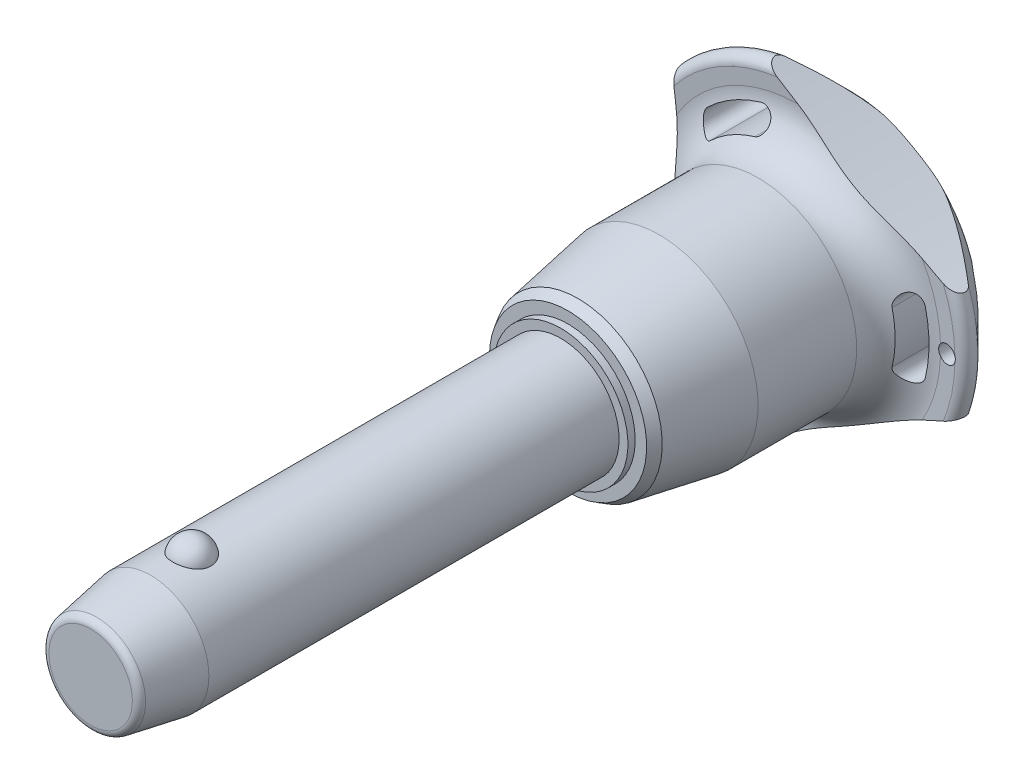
from build123d import *

# Parameters (mm, degrees)
SKETCH1_R           = 10
BOSS_EXTRUDE1_DEPTH = 60
SKETCH2_R           = 8.75
BOSS_EXTRUDE2_DEPTH = 50.7
BOSS_EXTRUDE3_START = 20.5
SKETCH1_2_R         = 10
BOSS_EXTRUDE3_DEPTH = 20.5
CHAMFER1_SIZE       = 10.25
CHAMFER1_SIZE2      = 1.807351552
FILLET1_R           = 1.25
SKETCH6_R           = 176.92625
CUT_EXTRUDE1_DEPTH  = 118.833791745
CIRPATTERN1_COUNT   = 3
SKETCH7_R           = 1.5
CUT_EXTRUDE2_DEPTH  = 118.704532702


with BuildPart() as part:
    # Sketch1 → Boss-Extrude1 (new body)
    with BuildSketch(Plane.XY):
        Circle(SKETCH1_R)
    extrude(amount=-BOSS_EXTRUDE1_DEPTH)

    # Sketch2 → Boss-Extrude2 (add)
    with BuildSketch(Plane(origin=(0, 0, -60), x_dir=(-1, 0, 0), z_dir=(0, 0, -1))):
        with Locations(Location((0, 0, 0), (0, 0, 180))):
            Circle(SKETCH2_R)
    extrude(amount=BOSS_EXTRUDE2_DEPTH)

    # Sketch3 → Revolve1 (revolve)
    with BuildSketch(Plane(origin=(0, 0, 0), x_dir=(0, 0, -1), z_dir=(1, 0, 0))):
        with BuildLine():
            Line((-3.201562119, 12.5), (-3.201562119, 5.9))
            ThreePointArc((-3.201562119, 5.9), (0.098437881, 9.2), (-3.201562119, 12.5))
        make_face()
        with BuildLine():
            Line((-3.201562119, -5.9), (-3.201562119, -12.5))
            ThreePointArc((-3.201562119, -12.5), (0.098437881, -9.2), (-3.201562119, -5.9))
        make_face()
    revolve(axis=Axis((0, -5.9, 3.201562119), (0, 1, 0)))

    # Sketch1_2 → Boss-Extrude3 (add)
    with BuildSketch(Plane.XY.offset(BOSS_EXTRUDE3_START)):
        Circle(SKETCH1_2_R)
    extrude(amount=-BOSS_EXTRUDE3_DEPTH)

    # Chamfer1
    chamfer1_edges = [part.edges().sort_by_distance(p)[0] for p in [
        (-10, 0, 20.5),
    ]]
    chamfer1_side = [part.faces().sort_by_distance(p)[0] for p in [
        (-10, 0, -19.75),
    ]]
    chamfer(chamfer1_edges, length=CHAMFER1_SIZE, length2=CHAMFER1_SIZE2, reference=chamfer1_side[0])

    # Fillet1
    fillet1_edges = [part.edges().sort_by_distance(p)[0] for p in [
        (-8.192648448, 0, 20.5),
        (-8.75, 0, -110.7),
    ]]
    fillet(fillet1_edges, radius=FILLET1_R)

    # Sketch4 → Revolve2 (revolve)
    with BuildSketch(Plane(origin=(0, 0, 0), x_dir=(0, 0, -1), z_dir=(1, 0, 0)), mode=Mode.PRIVATE) as revolve2_sk:
        Polygon((60, 0), (60, 11.504815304), (61.25, 11.504815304), (61.25, 13.461079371), (62.944174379, 14.439211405), (76.9, 16.9), (93.8, 16.9), (93.8, 0), align=None)
    revolve(revolve2_sk.sketch.rotate(Axis((0, 0, -93.8), (0, 0, 1)), 90), axis=Axis((0, 0, -93.8), (0, 0, 1)))

    # Sketch5 → Revolve3 (revolve)
    with BuildSketch(Plane(origin=(0, 0, 0), x_dir=(0, 0, -1), z_dir=(1, 0, 0)), mode=Mode.PRIVATE) as revolve3_sk:
        with BuildLine():
            Line((100.790129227, 24.271609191), (100.652256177, 26.865060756))
            ThreePointArc((100.652256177, 26.865060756), (101.598671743, 28.411427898), (103.38137085, 28.08137085))
            Line((103.38137085, 28.08137085), (109.763226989, 21.69951471))
            ThreePointArc((109.763226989, 21.69951471), (110.7, 19.381044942), (109.683055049, 17.096604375))
            ThreePointArc((109.683055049, 17.096604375), (104.18864484, 9.321268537), (102.25, 0))
            Line((102.25, 0), (93.8, 0))
            Line((93.8, 0), (93.8, 16.9))
            ThreePointArc((93.8, 16.9), (98.879432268, 19.083427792), (100.790129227, 24.271609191))
        make_face()
    revolve(revolve3_sk.sketch.rotate(Axis((0, 0, -102.25), (0, 0, 1)), 90), axis=Axis((0, 0, -102.25), (0, 0, 1)))

    # Sketch6 → Cut-Extrude1 (cut, through all)
    with BuildSketch(Plane.XY):
        with Locations((-197.42625, 0)):
            Circle(SKETCH6_R)
        with BuildLine():
            ThreePointArc((21.802992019, -5.260839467), (22.428706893, 0), (21.802992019, 5.260839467))
            ThreePointArc((21.802992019, 5.260839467), (19.579234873, 6.620060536), (18.220013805, 4.39630339))
            ThreePointArc((18.220013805, 4.39630339), (18.742902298, 0), (18.220013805, -4.39630339))
            ThreePointArc((18.220013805, -4.39630339), (19.579234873, -6.620060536), (21.802992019, -5.260839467))
        make_face()
    cut_extrude1 = extrude(amount=-CUT_EXTRUDE1_DEPTH, mode=Mode.SUBTRACT)

    # CirPattern1: Cut-Extrude1 ×3 about axis
    cirpattern1_axis = Axis((0, 0, 0), (0, 0, 1))
    for i in range(1, CIRPATTERN1_COUNT):
        add(cut_extrude1.rotate(cirpattern1_axis, i * 360 / CIRPATTERN1_COUNT), mode=Mode.SUBTRACT)

    # Sketch7 → Cut-Extrude2 (cut, through all)
    with BuildSketch(Plane.XY):
        with Locations(Location((25.428706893, 0, 0), (0, 0, 17.230769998))):
            Circle(SKETCH7_R)
    extrude(amount=-CUT_EXTRUDE2_DEPTH, mode=Mode.SUBTRACT)


solid = part.part
